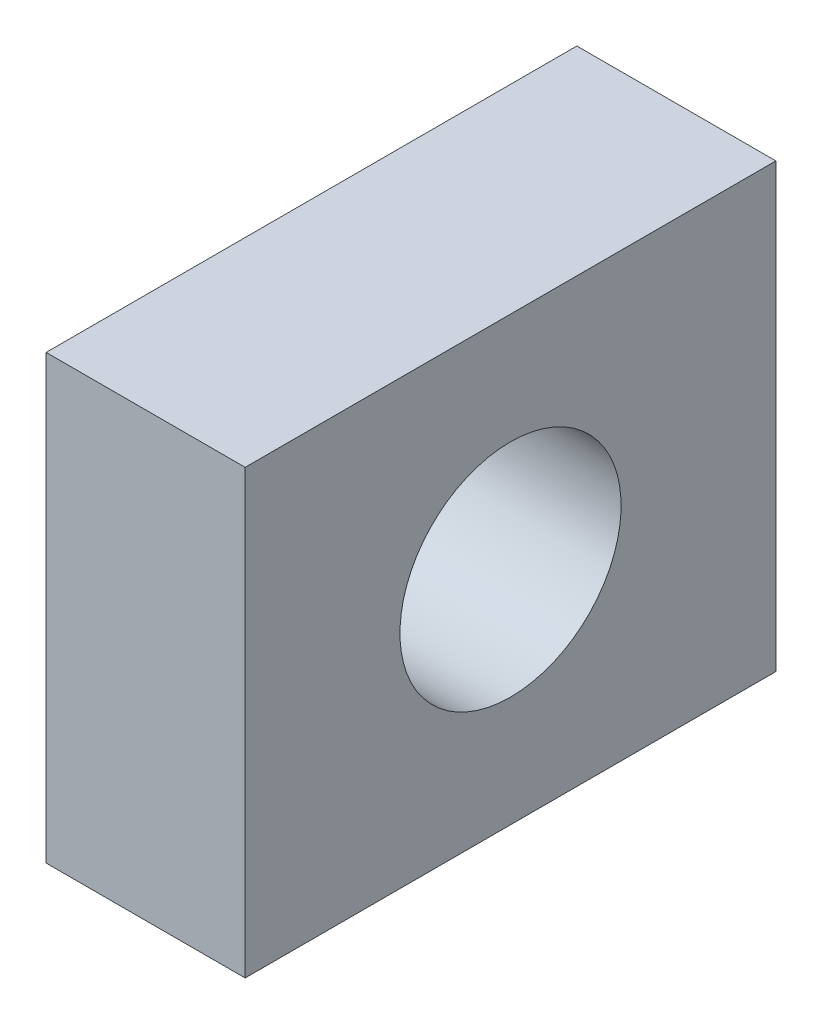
ISO-10303-21;
HEADER;
FILE_DESCRIPTION(('STEP AP214'),'2;1');
FILE_NAME('part.step','',(''),(''),'','','');
FILE_SCHEMA(('AUTOMOTIVE_DESIGN { 1 0 10303 214 1 1 1 1 }'));
ENDSEC;
DATA;
#1=APPLICATION_CONTEXT('core data for automotive mechanical design processes');
#2=APPLICATION_PROTOCOL_DEFINITION('international standard','automotive_design',2000,#1);
#3=PRODUCT_CONTEXT('',#1,'mechanical');
#4=PRODUCT('Part','Part','',(#3));
#5=PRODUCT_RELATED_PRODUCT_CATEGORY('part','',(#4));
#6=PRODUCT_DEFINITION_FORMATION('','',#4);
#7=PRODUCT_DEFINITION_CONTEXT('part definition',#1,'design');
#8=PRODUCT_DEFINITION('design','',#6,#7);
#9=PRODUCT_DEFINITION_SHAPE('','',#8);
#10=(LENGTH_UNIT() NAMED_UNIT(*) SI_UNIT(.MILLI.,.METRE.));
#11=(NAMED_UNIT(*) PLANE_ANGLE_UNIT() SI_UNIT($,.RADIAN.));
#12=(NAMED_UNIT(*) SI_UNIT($,.STERADIAN.) SOLID_ANGLE_UNIT());
#13=UNCERTAINTY_MEASURE_WITH_UNIT(LENGTH_MEASURE(1.E-05),#10,'distance_accuracy_value','');
#14=(GEOMETRIC_REPRESENTATION_CONTEXT(3) GLOBAL_UNCERTAINTY_ASSIGNED_CONTEXT((#13)) GLOBAL_UNIT_ASSIGNED_CONTEXT((#10,
#11,#12)) REPRESENTATION_CONTEXT('',''));
#15=CARTESIAN_POINT('',(0.,0.,0.));
#16=DIRECTION('',(0.,0.,1.));
#17=DIRECTION('',(1.,0.,0.));
#18=AXIS2_PLACEMENT_3D('',#15,#16,#17);
#19=CARTESIAN_POINT('',(-22.2490897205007,23.6645962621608,24.));
#20=DIRECTION('',(1.,0.,0.));
#21=DIRECTION('',(0.,1.,0.));
#22=AXIS2_PLACEMENT_3D('',#19,#20,#21);
#23=PLANE('',#22);
#24=CARTESIAN_POINT('',(-22.2490897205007,13.6645962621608,12.));
#25=DIRECTION('',(1.,0.,0.));
#26=DIRECTION('',(0.,1.,0.));
#27=AXIS2_PLACEMENT_3D('',#24,#25,#26);
#28=CIRCLE('',#27,5.);
#29=CARTESIAN_POINT('',(-22.2490897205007,18.6645962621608,12.));
#30=VERTEX_POINT('',#29);
#31=EDGE_CURVE('E102',#30,#30,#28,.T.);
#32=ORIENTED_EDGE('',*,*,#31,.T.);
#33=EDGE_LOOP('',(#32));
#34=FACE_BOUND('',#33,.T.);
#35=DIRECTION('',(0.,-1.,0.));
#36=VECTOR('',#35,1.);
#37=CARTESIAN_POINT('',(-22.2490897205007,23.6645962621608,0.));
#38=LINE('',#37,#36);
#39=CARTESIAN_POINT('',(-22.2490897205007,23.6645962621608,0.));
#40=VERTEX_POINT('',#39);
#41=CARTESIAN_POINT('',(-22.2490897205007,3.66459626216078,0.));
#42=VERTEX_POINT('',#41);
#43=EDGE_CURVE('E99',#40,#42,#38,.T.);
#44=ORIENTED_EDGE('',*,*,#43,.T.);
#45=DIRECTION('',(0.,0.,-1.));
#46=VECTOR('',#45,1.);
#47=CARTESIAN_POINT('',(-22.2490897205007,3.66459626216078,24.));
#48=LINE('',#47,#46);
#49=CARTESIAN_POINT('',(-22.2490897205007,3.66459626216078,24.));
#50=VERTEX_POINT('',#49);
#51=EDGE_CURVE('E11',#50,#42,#48,.T.);
#52=ORIENTED_EDGE('',*,*,#51,.F.);
#53=DIRECTION('',(0.,-1.,0.));
#54=VECTOR('',#53,1.);
#55=CARTESIAN_POINT('',(-22.2490897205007,23.6645962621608,24.));
#56=LINE('',#55,#54);
#57=CARTESIAN_POINT('',(-22.2490897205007,23.6645962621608,24.));
#58=VERTEX_POINT('',#57);
#59=EDGE_CURVE('E87',#58,#50,#56,.T.);
#60=ORIENTED_EDGE('',*,*,#59,.F.);
#61=DIRECTION('',(0.,0.,-1.));
#62=VECTOR('',#61,1.);
#63=CARTESIAN_POINT('',(-22.2490897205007,23.6645962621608,24.));
#64=LINE('',#63,#62);
#65=EDGE_CURVE('E95',#58,#40,#64,.T.);
#66=ORIENTED_EDGE('',*,*,#65,.T.);
#67=EDGE_LOOP('',(#44,#52,#60,#66));
#68=FACE_BOUND('',#67,.T.);
#69=ADVANCED_FACE('F36',(#34,#68),#23,.F.);
#70=CARTESIAN_POINT('',(-22.2490897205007,3.66459626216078,24.));
#71=DIRECTION('',(0.,1.,0.));
#72=DIRECTION('',(0.,0.,1.));
#73=AXIS2_PLACEMENT_3D('',#70,#71,#72);
#74=PLANE('',#73);
#75=DIRECTION('',(1.,0.,0.));
#76=VECTOR('',#75,1.);
#77=CARTESIAN_POINT('',(-22.2490897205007,3.66459626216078,0.));
#78=LINE('',#77,#76);
#79=CARTESIAN_POINT('',(-13.2490897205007,3.66459626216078,0.));
#80=VERTEX_POINT('',#79);
#81=EDGE_CURVE('E91',#42,#80,#78,.T.);
#82=ORIENTED_EDGE('',*,*,#81,.T.);
#83=DIRECTION('',(0.,0.,-1.));
#84=VECTOR('',#83,1.);
#85=CARTESIAN_POINT('',(-13.2490897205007,3.66459626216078,24.));
#86=LINE('',#85,#84);
#87=CARTESIAN_POINT('',(-13.2490897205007,3.66459626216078,24.));
#88=VERTEX_POINT('',#87);
#89=EDGE_CURVE('E44',#88,#80,#86,.T.);
#90=ORIENTED_EDGE('',*,*,#89,.F.);
#91=DIRECTION('',(1.,0.,0.));
#92=VECTOR('',#91,1.);
#93=CARTESIAN_POINT('',(-22.2490897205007,3.66459626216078,24.));
#94=LINE('',#93,#92);
#95=EDGE_CURVE('E82',#50,#88,#94,.T.);
#96=ORIENTED_EDGE('',*,*,#95,.F.);
#97=ORIENTED_EDGE('',*,*,#51,.T.);
#98=EDGE_LOOP('',(#82,#90,#96,#97));
#99=FACE_BOUND('',#98,.T.);
#100=ADVANCED_FACE('F90',(#99),#74,.F.);
#101=CARTESIAN_POINT('',(-13.2490897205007,23.6645962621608,24.));
#102=DIRECTION('',(-1.,0.,0.));
#103=DIRECTION('',(0.,-1.,0.));
#104=AXIS2_PLACEMENT_3D('',#101,#102,#103);
#105=PLANE('',#104);
#106=CARTESIAN_POINT('',(-13.2490897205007,13.6645962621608,12.));
#107=DIRECTION('',(1.,0.,0.));
#108=DIRECTION('',(0.,1.,0.));
#109=AXIS2_PLACEMENT_3D('',#106,#107,#108);
#110=CIRCLE('',#109,5.);
#111=CARTESIAN_POINT('',(-13.2490897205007,18.6645962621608,12.));
#112=VERTEX_POINT('',#111);
#113=EDGE_CURVE('E113',#112,#112,#110,.T.);
#114=ORIENTED_EDGE('',*,*,#113,.F.);
#115=EDGE_LOOP('',(#114));
#116=FACE_BOUND('',#115,.T.);
#117=DIRECTION('',(0.,1.,0.));
#118=VECTOR('',#117,1.);
#119=CARTESIAN_POINT('',(-13.2490897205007,23.6645962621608,0.));
#120=LINE('',#119,#118);
#121=CARTESIAN_POINT('',(-13.2490897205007,23.6645962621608,0.));
#122=VERTEX_POINT('',#121);
#123=EDGE_CURVE('E69',#80,#122,#120,.T.);
#124=ORIENTED_EDGE('',*,*,#123,.T.);
#125=DIRECTION('',(0.,0.,-1.));
#126=VECTOR('',#125,1.);
#127=CARTESIAN_POINT('',(-13.2490897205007,23.6645962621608,24.));
#128=LINE('',#127,#126);
#129=CARTESIAN_POINT('',(-13.2490897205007,23.6645962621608,24.));
#130=VERTEX_POINT('',#129);
#131=EDGE_CURVE('E92',#130,#122,#128,.T.);
#132=ORIENTED_EDGE('',*,*,#131,.F.);
#133=DIRECTION('',(0.,1.,0.));
#134=VECTOR('',#133,1.);
#135=CARTESIAN_POINT('',(-13.2490897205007,23.6645962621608,24.));
#136=LINE('',#135,#134);
#137=EDGE_CURVE('E85',#88,#130,#136,.T.);
#138=ORIENTED_EDGE('',*,*,#137,.F.);
#139=ORIENTED_EDGE('',*,*,#89,.T.);
#140=EDGE_LOOP('',(#124,#132,#138,#139));
#141=FACE_BOUND('',#140,.T.);
#142=ADVANCED_FACE('F93',(#116,#141),#105,.F.);
#143=CARTESIAN_POINT('',(-22.2490897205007,23.6645962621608,24.));
#144=DIRECTION('',(0.,-1.,0.));
#145=DIRECTION('',(0.,0.,-1.));
#146=AXIS2_PLACEMENT_3D('',#143,#144,#145);
#147=PLANE('',#146);
#148=DIRECTION('',(-1.,0.,0.));
#149=VECTOR('',#148,1.);
#150=CARTESIAN_POINT('',(-22.2490897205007,23.6645962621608,0.));
#151=LINE('',#150,#149);
#152=EDGE_CURVE('E75',#122,#40,#151,.T.);
#153=ORIENTED_EDGE('',*,*,#152,.T.);
#154=ORIENTED_EDGE('',*,*,#65,.F.);
#155=DIRECTION('',(-1.,0.,0.));
#156=VECTOR('',#155,1.);
#157=CARTESIAN_POINT('',(-22.2490897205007,23.6645962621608,24.));
#158=LINE('',#157,#156);
#159=EDGE_CURVE('E52',#130,#58,#158,.T.);
#160=ORIENTED_EDGE('',*,*,#159,.F.);
#161=ORIENTED_EDGE('',*,*,#131,.T.);
#162=EDGE_LOOP('',(#153,#154,#160,#161));
#163=FACE_BOUND('',#162,.T.);
#164=ADVANCED_FACE('F107',(#163),#147,.F.);
#165=CARTESIAN_POINT('',(0.,0.,24.));
#166=DIRECTION('',(0.,0.,1.));
#167=DIRECTION('',(1.,0.,0.));
#168=AXIS2_PLACEMENT_3D('',#165,#166,#167);
#169=PLANE('',#168);
#170=ORIENTED_EDGE('',*,*,#59,.T.);
#171=ORIENTED_EDGE('',*,*,#95,.T.);
#172=ORIENTED_EDGE('',*,*,#137,.T.);
#173=ORIENTED_EDGE('',*,*,#159,.T.);
#174=EDGE_LOOP('',(#170,#171,#172,#173));
#175=FACE_BOUND('',#174,.T.);
#176=ADVANCED_FACE('F83',(#175),#169,.T.);
#177=CARTESIAN_POINT('',(0.,0.,0.));
#178=DIRECTION('',(0.,0.,1.));
#179=DIRECTION('',(1.,0.,0.));
#180=AXIS2_PLACEMENT_3D('',#177,#178,#179);
#181=PLANE('',#180);
#182=ORIENTED_EDGE('',*,*,#43,.F.);
#183=ORIENTED_EDGE('',*,*,#152,.F.);
#184=ORIENTED_EDGE('',*,*,#123,.F.);
#185=ORIENTED_EDGE('',*,*,#81,.F.);
#186=EDGE_LOOP('',(#182,#183,#184,#185));
#187=FACE_BOUND('',#186,.T.);
#188=ADVANCED_FACE('F110',(#187),#181,.F.);
#189=CARTESIAN_POINT('',(-22.2490897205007,13.6645962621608,12.));
#190=DIRECTION('',(1.,0.,0.));
#191=DIRECTION('',(0.,1.,0.));
#192=AXIS2_PLACEMENT_3D('',#189,#190,#191);
#193=CYLINDRICAL_SURFACE('',#192,5.);
#194=ORIENTED_EDGE('',*,*,#31,.F.);
#195=EDGE_LOOP('',(#194));
#196=FACE_BOUND('',#195,.T.);
#197=ORIENTED_EDGE('',*,*,#113,.T.);
#198=EDGE_LOOP('',(#197));
#199=FACE_BOUND('',#198,.T.);
#200=ADVANCED_FACE('F122',(#196,#199),#193,.F.);
#201=CLOSED_SHELL('',(#69,#100,#142,#164,#176,#188,#200));
#202=MANIFOLD_SOLID_BREP('B2',#201);
#203=ADVANCED_BREP_SHAPE_REPRESENTATION('',(#18,#202),#14);
#204=SHAPE_DEFINITION_REPRESENTATION(#9,#203);
ENDSEC;
END-ISO-10303-21;
